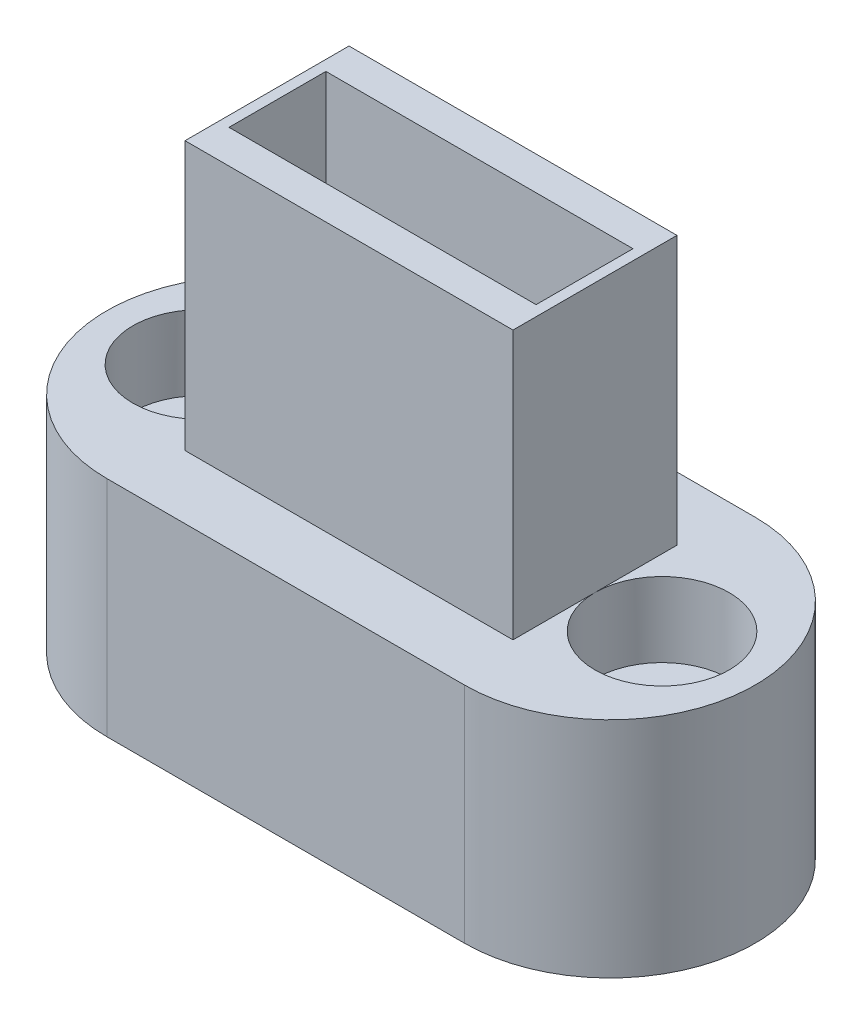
from build123d import *

# Parameters (mm, degrees)
BOSS_EXTRU_1_DEPTH      = 15
ESQUISSE3_W             = 22
ESQUISSE3_H             = 11
BOSS_EXTRU_2_DEPTH      = 18
ESQUISSE4_W             = 20.2
ESQUISSE4_H             = 6.5
ENL_V_MAT_EXTRU_1_DEPTH = 6
ESQUISSE5_W             = 20.2
ESQUISSE5_H             = 3
ENL_V_MAT_EXTRU_2_DEPTH = 70.872953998
ESQUISSE6_W             = 20.2
ESQUISSE6_H             = 8.25
ENL_V_MAT_EXTRU_3_DEPTH = 3
ESQUISSE7_R             = 4.5
ENL_V_MAT_EXTRU_4_DEPTH = 5
ESQUISSE8_R             = 4.5
ENL_V_MAT_EXTRU_5_DEPTH = 5
ESQUISSE9_R             = 2.25
ENL_V_MAT_EXTRU_6_DEPTH = 69.426820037
ESQUISSE10_R            = 2.25
ENL_V_MAT_EXTRU_8_DEPTH = 69.426820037
ESQUISSE11_W            = 20.6
ESQUISSE11_H            = 6.5
ENL_V_MAT_EXTRU_9_DEPTH = 7


with BuildPart() as part:
    # Esquisse2 → Boss.-Extru.1 (new body)
    with BuildSketch(Plane(origin=(0, 0, 0), x_dir=(1, 0, 0), z_dir=(0, 1, 0))):
        with BuildLine():
            Line((-53.953745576, 9.75), (-29.953745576, 9.75))
            ThreePointArc((-29.953745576, 9.75), (-20.203745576, 0), (-29.953745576, -9.75))
            Line((-29.953745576, -9.75), (-53.953745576, -9.75))
            ThreePointArc((-53.953745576, -9.75), (-63.703745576, 0), (-53.953745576, 9.75))
        make_face()
    extrude(amount=BOSS_EXTRU_1_DEPTH)

    # Esquisse3 → Boss.-Extru.2 (add)
    with BuildSketch(Plane(origin=(0, 15, 0), x_dir=(1, 0, 0), z_dir=(0, 1, 0))):
        with Locations((-41.953745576, 0)):
            Rectangle(ESQUISSE3_W, ESQUISSE3_H)
    extrude(amount=BOSS_EXTRU_2_DEPTH)

    # Esquisse4 → Enl_v. mat.-Extru.1 (cut)
    with BuildSketch(Plane(origin=(0, 33, 0), x_dir=(1, 0, 0), z_dir=(0, 1, 0))):
        with Locations((-41.953745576, 0)):
            Rectangle(ESQUISSE4_W, ESQUISSE4_H)
    extrude(amount=-ENL_V_MAT_EXTRU_1_DEPTH, mode=Mode.SUBTRACT)

    # Esquisse5 → Enl_v. mat.-Extru.2 (cut, through all)
    with BuildSketch(Plane(origin=(0, 27, 0), x_dir=(1, 0, 0), z_dir=(0, 1, 0))):
        with Locations((-41.953745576, 0)):
            Rectangle(ESQUISSE5_W, ESQUISSE5_H)
    extrude(amount=-ENL_V_MAT_EXTRU_2_DEPTH, mode=Mode.SUBTRACT)

    # Esquisse6 → Enl_v. mat.-Extru.3 (cut)
    with BuildSketch(Plane.XZ):
        with Locations((-41.953745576, -5.625)):
            Rectangle(ESQUISSE6_W, ESQUISSE6_H)
    extrude(amount=-ENL_V_MAT_EXTRU_3_DEPTH, mode=Mode.SUBTRACT)

    # Esquisse7 → Enl_v. mat.-Extru.4 (cut)
    with BuildSketch(Plane(origin=(0, 15, 0), x_dir=(1, 0, 0), z_dir=(0, 1, 0))):
        with Locations(Location((-26.453745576, 0, 0), (0, 0, 270))):
            Circle(ESQUISSE7_R)
    extrude(amount=-ENL_V_MAT_EXTRU_4_DEPTH, mode=Mode.SUBTRACT)

    # Esquisse8 → Enl_v. mat.-Extru.5 (cut)
    with BuildSketch(Plane(origin=(0, 15, 0), x_dir=(1, 0, 0), z_dir=(0, 1, 0))):
        with Locations(Location((-57.453745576, 0, 0), (0, 0, 270))):
            Circle(ESQUISSE8_R)
    extrude(amount=-ENL_V_MAT_EXTRU_5_DEPTH, mode=Mode.SUBTRACT)

    # Esquisse9 → Enl_v. mat.-Extru.6 (cut, through all)
    with BuildSketch(Plane(origin=(0, 10, 0), x_dir=(1, 0, 0), z_dir=(0, 1, 0))):
        with Locations(Location((-26.453745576, 0, 0), (0, 0, 270))):
            Circle(ESQUISSE9_R)
    extrude(amount=-ENL_V_MAT_EXTRU_6_DEPTH, mode=Mode.SUBTRACT)

    # Esquisse10 → Enl_v. mat.-Extru.8 (cut, through all)
    with BuildSketch(Plane(origin=(0, 10, 0), x_dir=(1, 0, 0), z_dir=(0, 1, 0))):
        with Locations(Location((-57.453745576, 0, 0), (0, 0, 270))):
            Circle(ESQUISSE10_R)
    extrude(amount=-ENL_V_MAT_EXTRU_8_DEPTH, mode=Mode.SUBTRACT)

    # Esquisse11 → Enl_v. mat.-Extru.9 (cut)
    with BuildSketch(Plane(origin=(0, 33, 0), x_dir=(1, 0, 0), z_dir=(0, 1, 0))):
        with Locations((-41.953745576, 0)):
            Rectangle(ESQUISSE11_W, ESQUISSE11_H)
    extrude(amount=-ENL_V_MAT_EXTRU_9_DEPTH, mode=Mode.SUBTRACT)


solid = part.part
